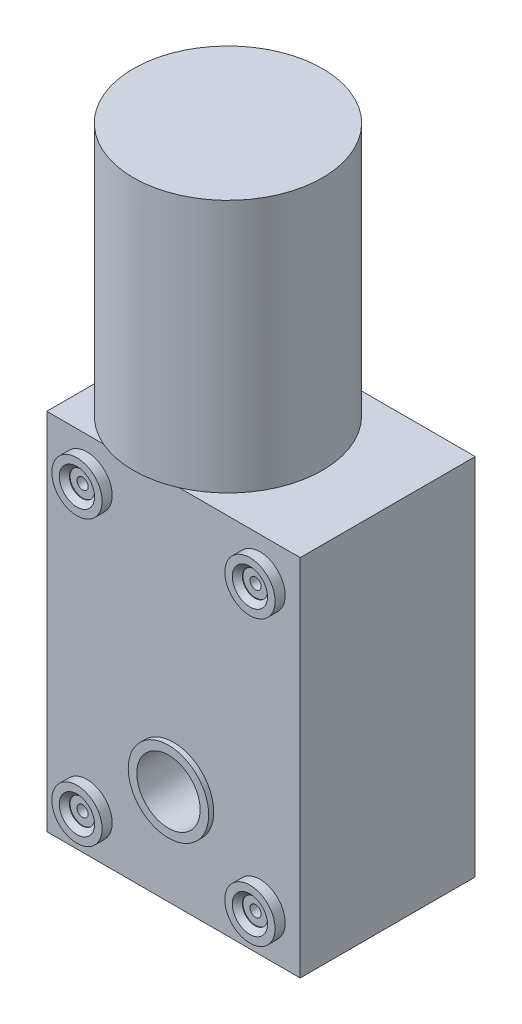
from build123d import *

# Parameters (mm, degrees)
SKETCH1_W                                   = 32.004
SKETCH1_H                                   = 22.098
BOSS_EXTRUDE1_DEPTH                         = 45.974
SKETCH2_R                                   = 11.938
BOSS_EXTRUDE2_DEPTH                         = 32.004
SKETCH3_R                                   = 3.175
BOSS_EXTRUDE3_DEPTH                         = 1.27
SKETCH5_R                                   = 5.08
BOSS_EXTRUDE4_DEPTH                         = 0.635
CBORE_FOR_00_BINDING_HEAD_MACHINE_S_2_COUNT = 2
CBORE_FOR_00_BINDING_HEAD_MACHINE_S_2_PITCH = 35.814
CBORE_FOR_00_BINDING_HEAD_MACHINE_S_3_COUNT = 2
CBORE_FOR_00_BINDING_HEAD_MACHINE_S_3_PITCH = 41.950005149
CBORE_FOR_00_BINDING_HEAD_MACHINE_S_4_COUNT = 2
CBORE_FOR_00_BINDING_HEAD_MACHINE_S_4_PITCH = 21.844
SKETCH8_R                                   = 4.0005
CUT_EXTRUDE1_DEPTH                          = 12.7


with BuildPart() as part:
    # Sketch1 → Boss-Extrude1 (new body)
    with BuildSketch(Plane(origin=(0, 0, 0), x_dir=(1, 0, 0), z_dir=(0, 1, 0))):
        with Locations((16.002, 11.049)):
            Rectangle(SKETCH1_W, SKETCH1_H)
    extrude(amount=BOSS_EXTRUDE1_DEPTH)

    # Sketch2 → Boss-Extrude2 (add)
    with BuildSketch(Plane(origin=(0, 45.974, 0), x_dir=(1, 0, 0), z_dir=(0, 1, 0))):
        with Locations(Location((11.938, 10.940435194, 0), (0, 0, 69.167801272))):
            Circle(SKETCH2_R)
    extrude(amount=BOSS_EXTRUDE2_DEPTH)

    # Sketch3 → Boss-Extrude3 (add)
    with BuildSketch(Plane.XY):
        with Locations(Location((5.08, 5.08, 0), (0, 0, 180))):
            Circle(SKETCH3_R)
        with Locations(Location((5.08, 40.894, 0), (0, 0, 180))):
            Circle(SKETCH3_R)
        with Locations(Location((26.924, 40.894, 0), (0, 0, 180))):
            Circle(SKETCH3_R)
        with Locations(Location((26.924, 5.08, 0), (0, 0, 180))):
            Circle(SKETCH3_R)
    extrude(amount=BOSS_EXTRUDE3_DEPTH)

    # Sketch5 → Boss-Extrude4 (add)
    with BuildSketch(Plane.XY):
        with Locations(Location((16.002, 12.7, 0), (0, 0, 180))):
            Circle(SKETCH5_R)
    extrude(amount=BOSS_EXTRUDE4_DEPTH)

    # Sketch7 → CBORE for _00 Binding Head Machine Screw (revolve, cut)
    with BuildSketch(Plane(origin=(5.08, 5.08, 1.27), x_dir=(0, -1, 0), z_dir=(1, 0, 0))):
        Polygon((0, 0), (0, 13.119701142), (0.6985, 12.7), (0.6985, 0.7112), (1.5875, 0.7112), (1.5875, 0.635), (2.2225, 0), align=None)
    cbore_for_00_binding_head_machine_screw = revolve(axis=Axis((5.08, 5.08, 7.62), (0, 0, -1)), mode=Mode.SUBTRACT)

    # CBORE for _00 Binding Head Machine S 2: CBORE for _00 Binding Head Machine Screw ×2
    with Locations(*[(0, i * CBORE_FOR_00_BINDING_HEAD_MACHINE_S_2_PITCH, 0) for i in range(1, CBORE_FOR_00_BINDING_HEAD_MACHINE_S_2_COUNT)]):
        add(cbore_for_00_binding_head_machine_screw, mode=Mode.SUBTRACT)

    # CBORE for _00 Binding Head Machine S 3: CBORE for _00 Binding Head Machine Screw ×2
    with Locations(*[Vector(0.5207150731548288, 0.8537305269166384, 0) * (i * CBORE_FOR_00_BINDING_HEAD_MACHINE_S_3_PITCH) for i in range(1, CBORE_FOR_00_BINDING_HEAD_MACHINE_S_3_COUNT)]):
        add(cbore_for_00_binding_head_machine_screw, mode=Mode.SUBTRACT)

    # CBORE for _00 Binding Head Machine S 4: CBORE for _00 Binding Head Machine Screw ×2
    with Locations(*[(i * CBORE_FOR_00_BINDING_HEAD_MACHINE_S_4_PITCH, 0, 0) for i in range(1, CBORE_FOR_00_BINDING_HEAD_MACHINE_S_4_COUNT)]):
        add(cbore_for_00_binding_head_machine_screw, mode=Mode.SUBTRACT)

    # Sketch8 → Cut-Extrude1 (cut)
    with BuildSketch(Plane.XY.offset(0.635)):
        with Locations((16.002, 12.7)):
            Circle(SKETCH8_R)
    extrude(amount=-CUT_EXTRUDE1_DEPTH, mode=Mode.SUBTRACT)


solid = part.part
